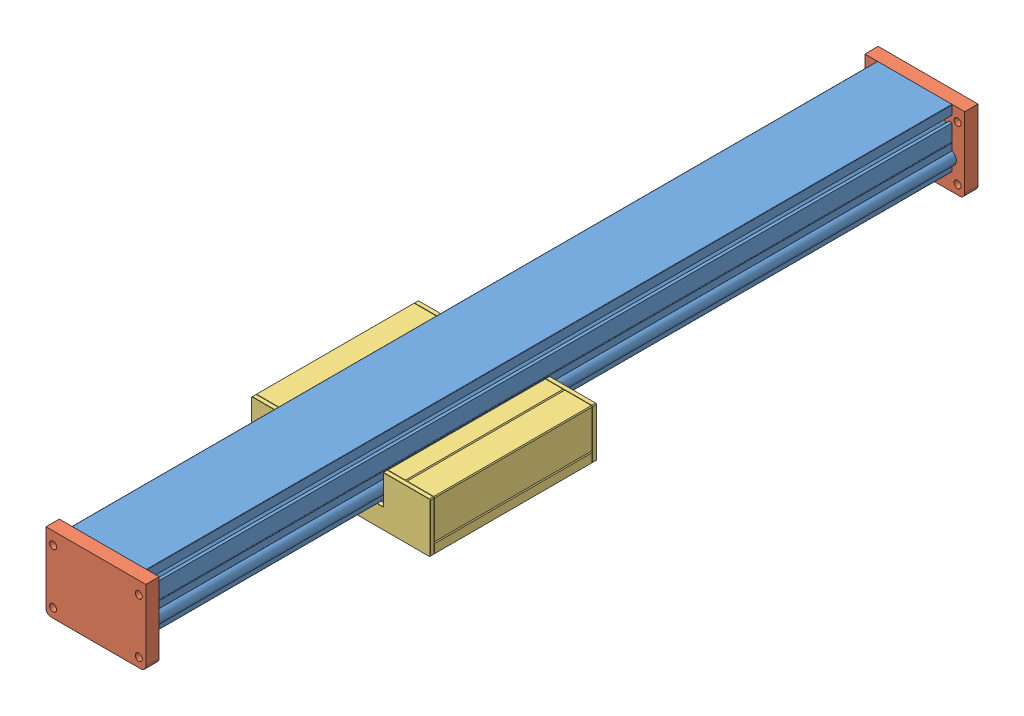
SolidWorks assembly MO090_200_1000.SLDASM, configuration Standard (file format 3800). Lengths in mm.
Overall size (215 95 1000).
4 component instances, 3 part files, 8 mates.
Components (placement in the parent):
- Profil_MZ090-1: Profil_MZ090.SLDPRT [l=968] at origin size (100.1 70 968)
- Endplatte_MO090-1: Endplatte_MO090.SLDPRT [vereinfacht] at (0 -13 0) x (0 0 1) z (1 0 0) size (16 91 120)
- Endplatte_MO090-2: Endplatte_MO090.SLDPRT [vereinfacht] at (0 -13 968) x (0 0 -1) z (-1 0 0) size (16 91 120)
- Schlitten_MZK090_200-1: Schlitten_MZK090_200.SLDPRT [Standard] at (0 35 589.7811) x (-1 0 0) z (0 0 1) size (215 60 200)
Mates (geometry in assembly coordinates):
- Deckungsgleich1: coincident anti-aligned: plane of Profil_MZ090-1 through (-45 35 0) normal (0 0 -1); plane of Endplatte_MO090-1 through (-54 -50 0) normal (0 0 1)
- Deckungsgleich2: coincident aligned: plane of Endplatte_MO090-1 through (60 35 -16) normal (0 1 0); plane of Profil_MZ090-1 through (-45 35 968) normal (0 1 0)
- Breite1: width: plane of Endplatte_MO090-1 through (60 -50 -16) normal (1 0 0); plane of Endplatte_MO090-1 through (-60 -50 -16) normal (-1 0 0); plane of Profil_MZ090-1 through (-45 35 968) normal (-1 0 0); plane of Profil_MZ090-1 through (45 35 968) normal (1 0 0)
- Deckungsgleich3: coincident anti-aligned: plane of Profil_MZ090-1 through (-45 35 968) normal (0 0 1); plane of Endplatte_MO090-2 through (54 -50 968) normal (0 0 -1)
- Deckungsgleich4: coincident aligned: plane of Endplatte_MO090-2 through (-60 35 984) normal (0 1 0); plane of Profil_MZ090-1 through (-45 35 968) normal (0 1 0)
- Breite2: width: plane of Endplatte_MO090-2 through (60 -50 984) normal (1 0 0); plane of Endplatte_MO090-2 through (-60 -50 984) normal (-1 0 0); plane of Profil_MZ090-1 through (-45 35 968) normal (-1 0 0); plane of Profil_MZ090-1 through (45 35 968) normal (1 0 0)
- Abstand1: distance = 95 mm anti-aligned: plane of Profil_MZ090-1 through (-45 35 968) normal (0 1 0); plane of Schlitten_MZK090_200-1 through (-107.5 -60 684.7811) normal (0 -1 0)
- Breite3: width: plane of Schlitten_MZK090_200-1 through (107.5 -60 684.7811) normal (1 0 0); plane of Schlitten_MZK090_200-1 through (-107.5 -60 684.7811) normal (-1 0 0); plane of Profil_MZ090-1 through (45 35 968) normal (1 0 0); plane of Profil_MZ090-1 through (-45 35 968) normal (-1 0 0)
